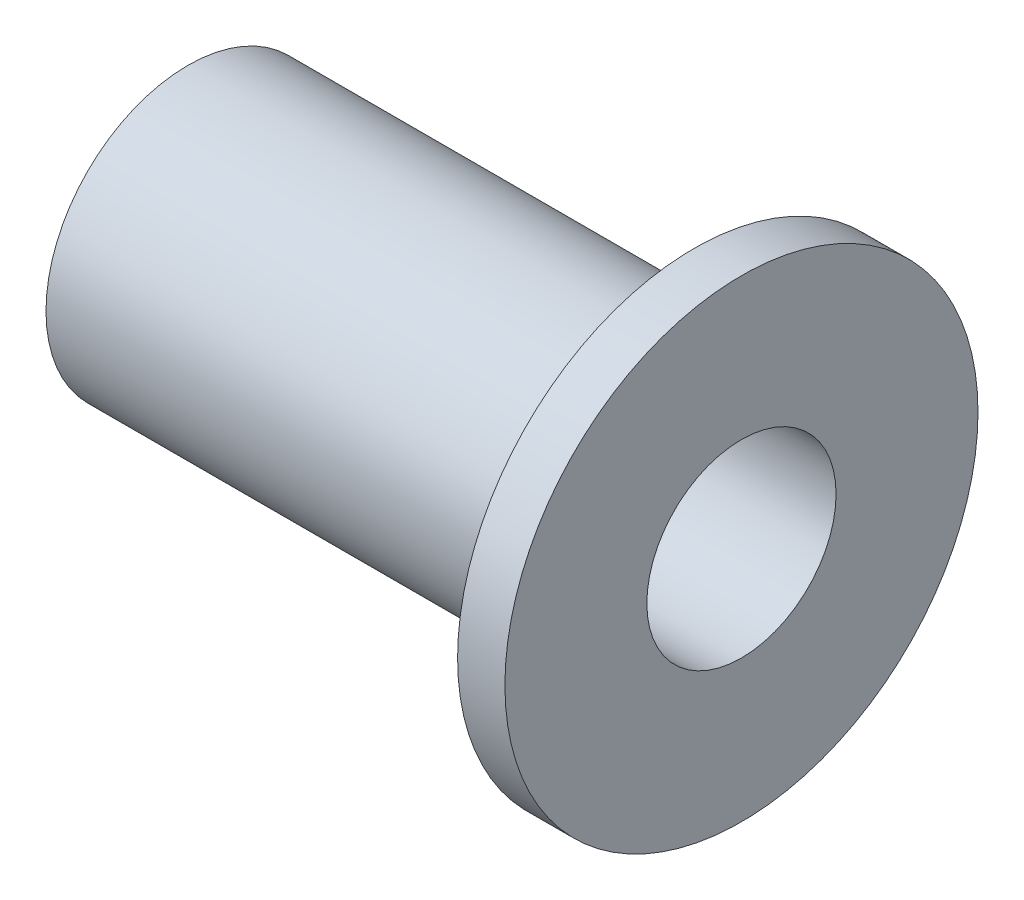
ISO-10303-21;
HEADER;
FILE_DESCRIPTION(('STEP AP214'),'2;1');
FILE_NAME('part.step','',(''),(''),'','','');
FILE_SCHEMA(('AUTOMOTIVE_DESIGN { 1 0 10303 214 1 1 1 1 }'));
ENDSEC;
DATA;
#1=APPLICATION_CONTEXT('core data for automotive mechanical design processes');
#2=APPLICATION_PROTOCOL_DEFINITION('international standard','automotive_design',2000,#1);
#3=PRODUCT_CONTEXT('',#1,'mechanical');
#4=PRODUCT('Part','Part','',(#3));
#5=PRODUCT_RELATED_PRODUCT_CATEGORY('part','',(#4));
#6=PRODUCT_DEFINITION_FORMATION('','',#4);
#7=PRODUCT_DEFINITION_CONTEXT('part definition',#1,'design');
#8=PRODUCT_DEFINITION('design','',#6,#7);
#9=PRODUCT_DEFINITION_SHAPE('','',#8);
#10=(LENGTH_UNIT() NAMED_UNIT(*) SI_UNIT(.MILLI.,.METRE.));
#11=(NAMED_UNIT(*) PLANE_ANGLE_UNIT() SI_UNIT($,.RADIAN.));
#12=(NAMED_UNIT(*) SI_UNIT($,.STERADIAN.) SOLID_ANGLE_UNIT());
#13=UNCERTAINTY_MEASURE_WITH_UNIT(LENGTH_MEASURE(1.E-05),#10,'distance_accuracy_value','');
#14=(GEOMETRIC_REPRESENTATION_CONTEXT(3) GLOBAL_UNCERTAINTY_ASSIGNED_CONTEXT((#13)) GLOBAL_UNIT_ASSIGNED_CONTEXT((#10,
#11,#12)) REPRESENTATION_CONTEXT('',''));
#15=CARTESIAN_POINT('',(0.,0.,0.));
#16=DIRECTION('',(0.,0.,1.));
#17=DIRECTION('',(1.,0.,0.));
#18=AXIS2_PLACEMENT_3D('',#15,#16,#17);
#19=CARTESIAN_POINT('',(-13.3047619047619,0.,0.));
#20=DIRECTION('',(-1.,0.,0.));
#21=DIRECTION('',(0.,0.,1.));
#22=AXIS2_PLACEMENT_3D('',#19,#20,#21);
#23=CYLINDRICAL_SURFACE('',#22,2.);
#24=CARTESIAN_POINT('',(11.7,0.,0.));
#25=DIRECTION('',(-1.,0.,0.));
#26=DIRECTION('',(0.,0.,1.));
#27=AXIS2_PLACEMENT_3D('',#24,#25,#26);
#28=CIRCLE('',#27,2.);
#29=CARTESIAN_POINT('',(11.7,0.,2.));
#30=VERTEX_POINT('',#29);
#31=EDGE_CURVE('E53',#30,#30,#28,.T.);
#32=ORIENTED_EDGE('',*,*,#31,.F.);
#33=EDGE_LOOP('',(#32));
#34=FACE_BOUND('',#33,.T.);
#35=CARTESIAN_POINT('',(0.,0.,0.));
#36=DIRECTION('',(-1.,0.,0.));
#37=DIRECTION('',(0.,0.,1.));
#38=AXIS2_PLACEMENT_3D('',#35,#36,#37);
#39=CIRCLE('',#38,2.);
#40=CARTESIAN_POINT('',(0.,0.,2.));
#41=VERTEX_POINT('',#40);
#42=EDGE_CURVE('E10',#41,#41,#39,.T.);
#43=ORIENTED_EDGE('',*,*,#42,.T.);
#44=EDGE_LOOP('',(#43));
#45=FACE_BOUND('',#44,.T.);
#46=ADVANCED_FACE('F31',(#34,#45),#23,.F.);
#47=CARTESIAN_POINT('',(0.,2.,0.));
#48=DIRECTION('',(1.,0.,0.));
#49=DIRECTION('',(0.,0.,-1.));
#50=AXIS2_PLACEMENT_3D('',#47,#48,#49);
#51=PLANE('',#50);
#52=ORIENTED_EDGE('',*,*,#42,.F.);
#53=EDGE_LOOP('',(#52));
#54=FACE_BOUND('',#53,.T.);
#55=CARTESIAN_POINT('',(0.,0.,0.));
#56=DIRECTION('',(-1.,0.,0.));
#57=DIRECTION('',(0.,0.,1.));
#58=AXIS2_PLACEMENT_3D('',#55,#56,#57);
#59=CIRCLE('',#58,3.);
#60=CARTESIAN_POINT('',(0.,0.,3.));
#61=VERTEX_POINT('',#60);
#62=EDGE_CURVE('E37',#61,#61,#59,.T.);
#63=ORIENTED_EDGE('',*,*,#62,.T.);
#64=EDGE_LOOP('',(#63));
#65=FACE_BOUND('',#64,.T.);
#66=ADVANCED_FACE('F60',(#54,#65),#51,.F.);
#67=CARTESIAN_POINT('',(-13.3047619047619,0.,0.));
#68=DIRECTION('',(-1.,0.,0.));
#69=DIRECTION('',(0.,0.,1.));
#70=AXIS2_PLACEMENT_3D('',#67,#68,#69);
#71=CYLINDRICAL_SURFACE('',#70,3.);
#72=ORIENTED_EDGE('',*,*,#62,.F.);
#73=EDGE_LOOP('',(#72));
#74=FACE_BOUND('',#73,.T.);
#75=CARTESIAN_POINT('',(10.1,0.,0.));
#76=DIRECTION('',(-1.,0.,0.));
#77=DIRECTION('',(0.,0.,1.));
#78=AXIS2_PLACEMENT_3D('',#75,#76,#77);
#79=CIRCLE('',#78,3.);
#80=CARTESIAN_POINT('',(10.1,0.,3.));
#81=VERTEX_POINT('',#80);
#82=EDGE_CURVE('E41',#81,#81,#79,.T.);
#83=ORIENTED_EDGE('',*,*,#82,.T.);
#84=EDGE_LOOP('',(#83));
#85=FACE_BOUND('',#84,.T.);
#86=ADVANCED_FACE('F64',(#74,#85),#71,.T.);
#87=CARTESIAN_POINT('',(10.7,0.,0.));
#88=DIRECTION('',(1.,0.,0.));
#89=DIRECTION('',(0.,0.,-1.));
#90=AXIS2_PLACEMENT_3D('',#87,#88,#89);
#91=CONICAL_SURFACE('',#90,5.,1.27933953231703);
#92=ORIENTED_EDGE('',*,*,#82,.F.);
#93=EDGE_LOOP('',(#92));
#94=FACE_BOUND('',#93,.T.);
#95=CARTESIAN_POINT('',(10.7,0.,0.));
#96=DIRECTION('',(-1.,0.,0.));
#97=DIRECTION('',(0.,0.,1.));
#98=AXIS2_PLACEMENT_3D('',#95,#96,#97);
#99=CIRCLE('',#98,5.);
#100=CARTESIAN_POINT('',(10.7,0.,5.));
#101=VERTEX_POINT('',#100);
#102=EDGE_CURVE('E45',#101,#101,#99,.T.);
#103=ORIENTED_EDGE('',*,*,#102,.T.);
#104=EDGE_LOOP('',(#103));
#105=FACE_BOUND('',#104,.T.);
#106=ADVANCED_FACE('F69',(#94,#105),#91,.T.);
#107=CARTESIAN_POINT('',(-13.3047619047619,0.,0.));
#108=DIRECTION('',(-1.,0.,0.));
#109=DIRECTION('',(0.,0.,1.));
#110=AXIS2_PLACEMENT_3D('',#107,#108,#109);
#111=CYLINDRICAL_SURFACE('',#110,5.);
#112=ORIENTED_EDGE('',*,*,#102,.F.);
#113=EDGE_LOOP('',(#112));
#114=FACE_BOUND('',#113,.T.);
#115=CARTESIAN_POINT('',(11.7,0.,0.));
#116=DIRECTION('',(-1.,0.,0.));
#117=DIRECTION('',(0.,0.,1.));
#118=AXIS2_PLACEMENT_3D('',#115,#116,#117);
#119=CIRCLE('',#118,5.);
#120=CARTESIAN_POINT('',(11.7,0.,5.));
#121=VERTEX_POINT('',#120);
#122=EDGE_CURVE('E50',#121,#121,#119,.T.);
#123=ORIENTED_EDGE('',*,*,#122,.T.);
#124=EDGE_LOOP('',(#123));
#125=FACE_BOUND('',#124,.T.);
#126=ADVANCED_FACE('F75',(#114,#125),#111,.T.);
#127=CARTESIAN_POINT('',(11.7,5.,0.));
#128=DIRECTION('',(-1.,0.,0.));
#129=DIRECTION('',(0.,0.,1.));
#130=AXIS2_PLACEMENT_3D('',#127,#128,#129);
#131=PLANE('',#130);
#132=ORIENTED_EDGE('',*,*,#122,.F.);
#133=EDGE_LOOP('',(#132));
#134=FACE_BOUND('',#133,.T.);
#135=ORIENTED_EDGE('',*,*,#31,.T.);
#136=EDGE_LOOP('',(#135));
#137=FACE_BOUND('',#136,.T.);
#138=ADVANCED_FACE('F57',(#134,#137),#131,.F.);
#139=CLOSED_SHELL('',(#46,#66,#86,#106,#126,#138));
#140=MANIFOLD_SOLID_BREP('B2',#139);
#141=ADVANCED_BREP_SHAPE_REPRESENTATION('',(#18,#140),#14);
#142=SHAPE_DEFINITION_REPRESENTATION(#9,#141);
ENDSEC;
END-ISO-10303-21;
